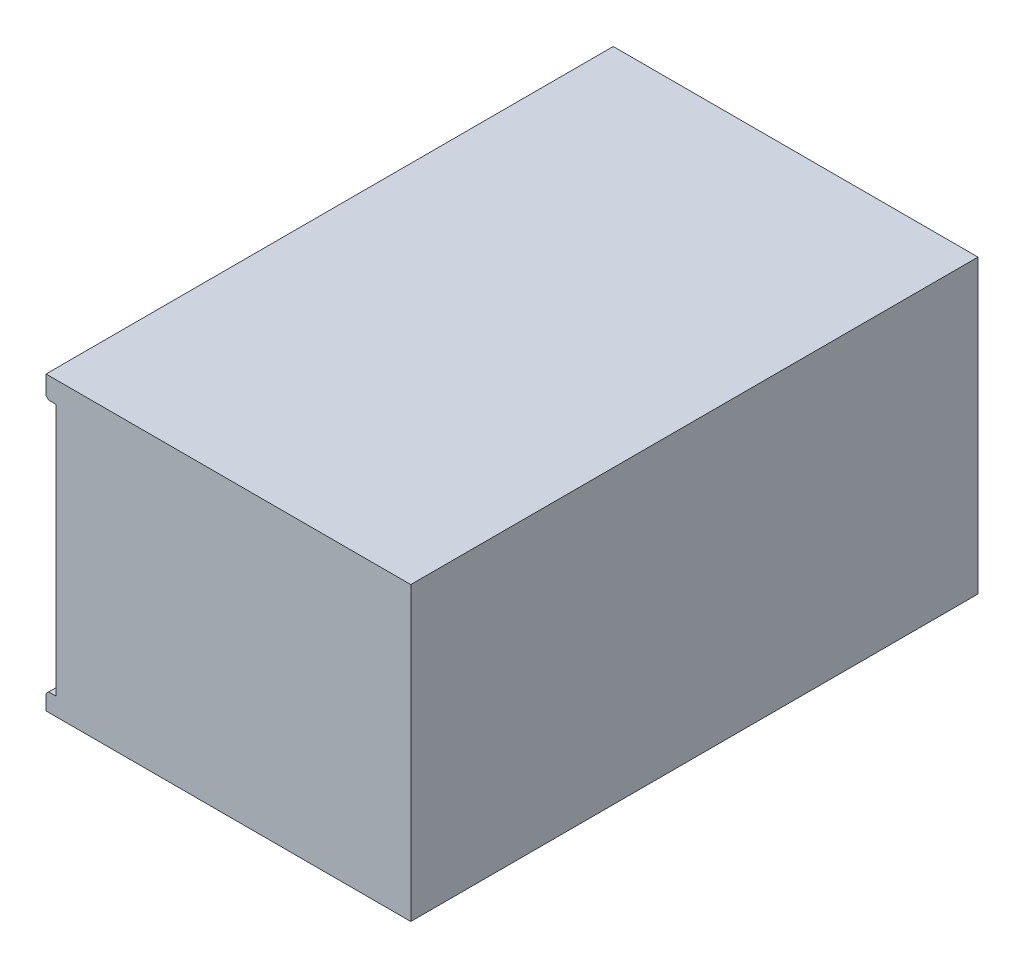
ISO-10303-21;
HEADER;
FILE_DESCRIPTION(('STEP AP214'),'2;1');
FILE_NAME('part.step','',(''),(''),'','','');
FILE_SCHEMA(('AUTOMOTIVE_DESIGN { 1 0 10303 214 1 1 1 1 }'));
ENDSEC;
DATA;
#1=APPLICATION_CONTEXT('core data for automotive mechanical design processes');
#2=APPLICATION_PROTOCOL_DEFINITION('international standard','automotive_design',2000,#1);
#3=PRODUCT_CONTEXT('',#1,'mechanical');
#4=PRODUCT('Part','Part','',(#3));
#5=PRODUCT_RELATED_PRODUCT_CATEGORY('part','',(#4));
#6=PRODUCT_DEFINITION_FORMATION('','',#4);
#7=PRODUCT_DEFINITION_CONTEXT('part definition',#1,'design');
#8=PRODUCT_DEFINITION('design','',#6,#7);
#9=PRODUCT_DEFINITION_SHAPE('','',#8);
#10=(LENGTH_UNIT() NAMED_UNIT(*) SI_UNIT(.MILLI.,.METRE.));
#11=(NAMED_UNIT(*) PLANE_ANGLE_UNIT() SI_UNIT($,.RADIAN.));
#12=(NAMED_UNIT(*) SI_UNIT($,.STERADIAN.) SOLID_ANGLE_UNIT());
#13=UNCERTAINTY_MEASURE_WITH_UNIT(LENGTH_MEASURE(1.E-05),#10,'distance_accuracy_value','');
#14=(GEOMETRIC_REPRESENTATION_CONTEXT(3) GLOBAL_UNCERTAINTY_ASSIGNED_CONTEXT((#13)) GLOBAL_UNIT_ASSIGNED_CONTEXT((#10,
#11,#12)) REPRESENTATION_CONTEXT('',''));
#15=CARTESIAN_POINT('',(0.,0.,0.));
#16=DIRECTION('',(0.,0.,1.));
#17=DIRECTION('',(1.,0.,0.));
#18=AXIS2_PLACEMENT_3D('',#15,#16,#17);
#19=CARTESIAN_POINT('',(-1.397,0.,40.4876));
#20=DIRECTION('',(0.,-1.,0.));
#21=DIRECTION('',(0.,0.,-1.));
#22=AXIS2_PLACEMENT_3D('',#19,#20,#21);
#23=PLANE('',#22);
#24=DIRECTION('',(-1.,0.,0.));
#25=VECTOR('',#24,1.);
#26=CARTESIAN_POINT('',(-1.397,0.,-40.4876));
#27=LINE('',#26,#25);
#28=CARTESIAN_POINT('',(50.673,0.,-40.4876));
#29=VERTEX_POINT('',#28);
#30=CARTESIAN_POINT('',(-1.397,0.,-40.4876));
#31=VERTEX_POINT('',#30);
#32=EDGE_CURVE('E180',#29,#31,#27,.T.);
#33=ORIENTED_EDGE('',*,*,#32,.T.);
#34=DIRECTION('',(0.,0.,-1.));
#35=VECTOR('',#34,1.);
#36=CARTESIAN_POINT('',(-1.397,0.,40.4876));
#37=LINE('',#36,#35);
#38=CARTESIAN_POINT('',(-1.397,0.,40.4876));
#39=VERTEX_POINT('',#38);
#40=EDGE_CURVE('E231',#39,#31,#37,.T.);
#41=ORIENTED_EDGE('',*,*,#40,.F.);
#42=DIRECTION('',(-1.,0.,0.));
#43=VECTOR('',#42,1.);
#44=CARTESIAN_POINT('',(-1.397,0.,40.4876));
#45=LINE('',#44,#43);
#46=CARTESIAN_POINT('',(50.673,0.,40.4876));
#47=VERTEX_POINT('',#46);
#48=EDGE_CURVE('E181',#47,#39,#45,.T.);
#49=ORIENTED_EDGE('',*,*,#48,.F.);
#50=DIRECTION('',(0.,0.,-1.));
#51=VECTOR('',#50,1.);
#52=CARTESIAN_POINT('',(50.673,0.,40.4876));
#53=LINE('',#52,#51);
#54=EDGE_CURVE('E200',#47,#29,#53,.T.);
#55=ORIENTED_EDGE('',*,*,#54,.T.);
#56=EDGE_LOOP('',(#33,#41,#49,#55));
#57=FACE_BOUND('',#56,.T.);
#58=ADVANCED_FACE('F37',(#57),#23,.F.);
#59=CARTESIAN_POINT('',(-1.397,-3.048,40.4876));
#60=DIRECTION('',(1.,0.,0.));
#61=DIRECTION('',(0.,0.,-1.));
#62=AXIS2_PLACEMENT_3D('',#59,#60,#61);
#63=PLANE('',#62);
#64=DIRECTION('',(0.,-1.,0.));
#65=VECTOR('',#64,1.);
#66=CARTESIAN_POINT('',(-1.397,-3.048,-40.4876));
#67=LINE('',#66,#65);
#68=CARTESIAN_POINT('',(-1.397,-2.66699999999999,-40.4876));
#69=VERTEX_POINT('',#68);
#70=EDGE_CURVE('E203',#31,#69,#67,.T.);
#71=ORIENTED_EDGE('',*,*,#70,.T.);
#72=DIRECTION('',(0.,0.,1.));
#73=VECTOR('',#72,1.);
#74=CARTESIAN_POINT('',(-1.397,-2.66699999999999,40.4876));
#75=LINE('',#74,#73);
#76=CARTESIAN_POINT('',(-1.397,-2.66699999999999,40.4876));
#77=VERTEX_POINT('',#76);
#78=EDGE_CURVE('E11',#69,#77,#75,.T.);
#79=ORIENTED_EDGE('',*,*,#78,.T.);
#80=DIRECTION('',(0.,-1.,0.));
#81=VECTOR('',#80,1.);
#82=CARTESIAN_POINT('',(-1.397,-3.048,40.4876));
#83=LINE('',#82,#81);
#84=EDGE_CURVE('E184',#39,#77,#83,.T.);
#85=ORIENTED_EDGE('',*,*,#84,.F.);
#86=ORIENTED_EDGE('',*,*,#40,.T.);
#87=EDGE_LOOP('',(#71,#79,#85,#86));
#88=FACE_BOUND('',#87,.T.);
#89=ADVANCED_FACE('F287',(#88),#63,.F.);
#90=CARTESIAN_POINT('',(0.,-3.048,40.4876));
#91=DIRECTION('',(0.,1.,0.));
#92=DIRECTION('',(0.,0.,1.));
#93=AXIS2_PLACEMENT_3D('',#90,#91,#92);
#94=PLANE('',#93);
#95=DIRECTION('',(1.,0.,0.));
#96=VECTOR('',#95,1.);
#97=CARTESIAN_POINT('',(0.,-3.048,40.4876));
#98=LINE('',#97,#96);
#99=CARTESIAN_POINT('',(-1.016,-3.048,40.4876));
#100=VERTEX_POINT('',#99);
#101=CARTESIAN_POINT('',(0.,-3.048,40.4876));
#102=VERTEX_POINT('',#101);
#103=EDGE_CURVE('E187',#100,#102,#98,.T.);
#104=ORIENTED_EDGE('',*,*,#103,.F.);
#105=DIRECTION('',(0.,0.,-1.));
#106=VECTOR('',#105,1.);
#107=CARTESIAN_POINT('',(-1.016,-3.048,40.4876));
#108=LINE('',#107,#106);
#109=CARTESIAN_POINT('',(-1.016,-3.048,-40.4876));
#110=VERTEX_POINT('',#109);
#111=EDGE_CURVE('E45',#100,#110,#108,.T.);
#112=ORIENTED_EDGE('',*,*,#111,.T.);
#113=DIRECTION('',(1.,0.,0.));
#114=VECTOR('',#113,1.);
#115=CARTESIAN_POINT('',(0.,-3.048,-40.4876));
#116=LINE('',#115,#114);
#117=CARTESIAN_POINT('',(0.,-3.048,-40.4876));
#118=VERTEX_POINT('',#117);
#119=EDGE_CURVE('E205',#110,#118,#116,.T.);
#120=ORIENTED_EDGE('',*,*,#119,.T.);
#121=DIRECTION('',(0.,0.,-1.));
#122=VECTOR('',#121,1.);
#123=CARTESIAN_POINT('',(0.,-3.048,40.4876));
#124=LINE('',#123,#122);
#125=EDGE_CURVE('E228',#102,#118,#124,.T.);
#126=ORIENTED_EDGE('',*,*,#125,.F.);
#127=EDGE_LOOP('',(#104,#112,#120,#126));
#128=FACE_BOUND('',#127,.T.);
#129=ADVANCED_FACE('F249',(#128),#94,.F.);
#130=CARTESIAN_POINT('',(0.,-39.116,40.4876));
#131=DIRECTION('',(1.,0.,0.));
#132=DIRECTION('',(0.,0.,-1.));
#133=AXIS2_PLACEMENT_3D('',#130,#131,#132);
#134=PLANE('',#133);
#135=CARTESIAN_POINT('',(0.,-6.35,-35.179));
#136=DIRECTION('',(-1.,0.,0.));
#137=DIRECTION('',(0.,0.,1.));
#138=AXIS2_PLACEMENT_3D('',#135,#136,#137);
#139=CIRCLE('',#138,2.413);
#140=CARTESIAN_POINT('',(0.,-6.35,-32.766));
#141=VERTEX_POINT('',#140);
#142=EDGE_CURVE('E141',#141,#141,#139,.T.);
#143=ORIENTED_EDGE('',*,*,#142,.F.);
#144=EDGE_LOOP('',(#143));
#145=FACE_BOUND('',#144,.T.);
#146=CARTESIAN_POINT('',(0.,-6.35,35.179));
#147=DIRECTION('',(-1.,0.,0.));
#148=DIRECTION('',(0.,0.,1.));
#149=AXIS2_PLACEMENT_3D('',#146,#147,#148);
#150=CIRCLE('',#149,2.413);
#151=CARTESIAN_POINT('',(0.,-6.35,37.592));
#152=VERTEX_POINT('',#151);
#153=EDGE_CURVE('E153',#152,#152,#150,.T.);
#154=ORIENTED_EDGE('',*,*,#153,.F.);
#155=EDGE_LOOP('',(#154));
#156=FACE_BOUND('',#155,.T.);
#157=CARTESIAN_POINT('',(0.,-35.814,-35.179));
#158=DIRECTION('',(-1.,0.,0.));
#159=DIRECTION('',(0.,0.,1.));
#160=AXIS2_PLACEMENT_3D('',#157,#158,#159);
#161=CIRCLE('',#160,2.413);
#162=CARTESIAN_POINT('',(0.,-35.814,-32.766));
#163=VERTEX_POINT('',#162);
#164=EDGE_CURVE('E165',#163,#163,#161,.T.);
#165=ORIENTED_EDGE('',*,*,#164,.F.);
#166=EDGE_LOOP('',(#165));
#167=FACE_BOUND('',#166,.T.);
#168=CARTESIAN_POINT('',(0.,-35.814,35.179));
#169=DIRECTION('',(-1.,0.,0.));
#170=DIRECTION('',(0.,0.,1.));
#171=AXIS2_PLACEMENT_3D('',#168,#169,#170);
#172=CIRCLE('',#171,2.413);
#173=CARTESIAN_POINT('',(0.,-35.814,37.592));
#174=VERTEX_POINT('',#173);
#175=EDGE_CURVE('E177',#174,#174,#172,.T.);
#176=ORIENTED_EDGE('',*,*,#175,.F.);
#177=EDGE_LOOP('',(#176));
#178=FACE_BOUND('',#177,.T.);
#179=DIRECTION('',(0.,-1.,0.));
#180=VECTOR('',#179,1.);
#181=CARTESIAN_POINT('',(0.,-39.116,-40.4876));
#182=LINE('',#181,#180);
#183=CARTESIAN_POINT('',(0.,-39.116,-40.4876));
#184=VERTEX_POINT('',#183);
#185=EDGE_CURVE('E207',#118,#184,#182,.T.);
#186=ORIENTED_EDGE('',*,*,#185,.T.);
#187=DIRECTION('',(0.,0.,-1.));
#188=VECTOR('',#187,1.);
#189=CARTESIAN_POINT('',(0.,-39.116,40.4876));
#190=LINE('',#189,#188);
#191=CARTESIAN_POINT('',(0.,-39.116,40.4876));
#192=VERTEX_POINT('',#191);
#193=EDGE_CURVE('E225',#192,#184,#190,.T.);
#194=ORIENTED_EDGE('',*,*,#193,.F.);
#195=DIRECTION('',(0.,-1.,0.));
#196=VECTOR('',#195,1.);
#197=CARTESIAN_POINT('',(0.,-39.116,40.4876));
#198=LINE('',#197,#196);
#199=EDGE_CURVE('E189',#102,#192,#198,.T.);
#200=ORIENTED_EDGE('',*,*,#199,.F.);
#201=ORIENTED_EDGE('',*,*,#125,.T.);
#202=EDGE_LOOP('',(#186,#194,#200,#201));
#203=FACE_BOUND('',#202,.T.);
#204=ADVANCED_FACE('F259',(#145,#156,#167,#178,#203),#134,.F.);
#205=CARTESIAN_POINT('',(-1.397,-39.116,40.4876));
#206=DIRECTION('',(0.,-1.,0.));
#207=DIRECTION('',(0.,0.,-1.));
#208=AXIS2_PLACEMENT_3D('',#205,#206,#207);
#209=PLANE('',#208);
#210=DIRECTION('',(-1.,0.,0.));
#211=VECTOR('',#210,1.);
#212=CARTESIAN_POINT('',(-1.397,-39.116,-40.4876));
#213=LINE('',#212,#211);
#214=CARTESIAN_POINT('',(-1.01599999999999,-39.116,-40.4876));
#215=VERTEX_POINT('',#214);
#216=EDGE_CURVE('E209',#184,#215,#213,.T.);
#217=ORIENTED_EDGE('',*,*,#216,.T.);
#218=DIRECTION('',(0.,0.,1.));
#219=VECTOR('',#218,1.);
#220=CARTESIAN_POINT('',(-1.01599999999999,-39.116,40.4876));
#221=LINE('',#220,#219);
#222=CARTESIAN_POINT('',(-1.01599999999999,-39.116,40.4876));
#223=VERTEX_POINT('',#222);
#224=EDGE_CURVE('E241',#215,#223,#221,.T.);
#225=ORIENTED_EDGE('',*,*,#224,.T.);
#226=DIRECTION('',(-1.,0.,0.));
#227=VECTOR('',#226,1.);
#228=CARTESIAN_POINT('',(-1.397,-39.116,40.4876));
#229=LINE('',#228,#227);
#230=EDGE_CURVE('E191',#192,#223,#229,.T.);
#231=ORIENTED_EDGE('',*,*,#230,.F.);
#232=ORIENTED_EDGE('',*,*,#193,.T.);
#233=EDGE_LOOP('',(#217,#225,#231,#232));
#234=FACE_BOUND('',#233,.T.);
#235=ADVANCED_FACE('F263',(#234),#209,.F.);
#236=CARTESIAN_POINT('',(-1.397,-41.656,40.4876));
#237=DIRECTION('',(1.,0.,0.));
#238=DIRECTION('',(0.,0.,-1.));
#239=AXIS2_PLACEMENT_3D('',#236,#237,#238);
#240=PLANE('',#239);
#241=DIRECTION('',(0.,-1.,0.));
#242=VECTOR('',#241,1.);
#243=CARTESIAN_POINT('',(-1.397,-41.656,40.4876));
#244=LINE('',#243,#242);
#245=CARTESIAN_POINT('',(-1.397,-39.497,40.4876));
#246=VERTEX_POINT('',#245);
#247=CARTESIAN_POINT('',(-1.397,-41.656,40.4876));
#248=VERTEX_POINT('',#247);
#249=EDGE_CURVE('E194',#246,#248,#244,.T.);
#250=ORIENTED_EDGE('',*,*,#249,.F.);
#251=DIRECTION('',(0.,0.,-1.));
#252=VECTOR('',#251,1.);
#253=CARTESIAN_POINT('',(-1.397,-39.497,40.4876));
#254=LINE('',#253,#252);
#255=CARTESIAN_POINT('',(-1.397,-39.497,-40.4876));
#256=VERTEX_POINT('',#255);
#257=EDGE_CURVE('E234',#246,#256,#254,.T.);
#258=ORIENTED_EDGE('',*,*,#257,.T.);
#259=DIRECTION('',(0.,-1.,0.));
#260=VECTOR('',#259,1.);
#261=CARTESIAN_POINT('',(-1.397,-41.656,-40.4876));
#262=LINE('',#261,#260);
#263=CARTESIAN_POINT('',(-1.397,-41.656,-40.4876));
#264=VERTEX_POINT('',#263);
#265=EDGE_CURVE('E212',#256,#264,#262,.T.);
#266=ORIENTED_EDGE('',*,*,#265,.T.);
#267=DIRECTION('',(0.,0.,-1.));
#268=VECTOR('',#267,1.);
#269=CARTESIAN_POINT('',(-1.397,-41.656,40.4876));
#270=LINE('',#269,#268);
#271=EDGE_CURVE('E222',#248,#264,#270,.T.);
#272=ORIENTED_EDGE('',*,*,#271,.F.);
#273=EDGE_LOOP('',(#250,#258,#266,#272));
#274=FACE_BOUND('',#273,.T.);
#275=ADVANCED_FACE('F271',(#274),#240,.F.);
#276=CARTESIAN_POINT('',(50.673,-41.656,40.4876));
#277=DIRECTION('',(0.,1.,0.));
#278=DIRECTION('',(-1.,0.,0.));
#279=AXIS2_PLACEMENT_3D('',#276,#277,#278);
#280=PLANE('',#279);
#281=DIRECTION('',(1.,0.,0.));
#282=VECTOR('',#281,1.);
#283=CARTESIAN_POINT('',(50.673,-41.656,-40.4876));
#284=LINE('',#283,#282);
#285=CARTESIAN_POINT('',(50.673,-41.656,-40.4876));
#286=VERTEX_POINT('',#285);
#287=EDGE_CURVE('E214',#264,#286,#284,.T.);
#288=ORIENTED_EDGE('',*,*,#287,.T.);
#289=DIRECTION('',(0.,0.,-1.));
#290=VECTOR('',#289,1.);
#291=CARTESIAN_POINT('',(50.673,-41.656,40.4876));
#292=LINE('',#291,#290);
#293=CARTESIAN_POINT('',(50.673,-41.656,40.4876));
#294=VERTEX_POINT('',#293);
#295=EDGE_CURVE('E219',#294,#286,#292,.T.);
#296=ORIENTED_EDGE('',*,*,#295,.F.);
#297=DIRECTION('',(1.,0.,0.));
#298=VECTOR('',#297,1.);
#299=CARTESIAN_POINT('',(50.673,-41.656,40.4876));
#300=LINE('',#299,#298);
#301=EDGE_CURVE('E196',#248,#294,#300,.T.);
#302=ORIENTED_EDGE('',*,*,#301,.F.);
#303=ORIENTED_EDGE('',*,*,#271,.T.);
#304=EDGE_LOOP('',(#288,#296,#302,#303));
#305=FACE_BOUND('',#304,.T.);
#306=ADVANCED_FACE('F278',(#305),#280,.F.);
#307=CARTESIAN_POINT('',(50.673,0.,40.4876));
#308=DIRECTION('',(-1.,0.,0.));
#309=DIRECTION('',(0.,0.,1.));
#310=AXIS2_PLACEMENT_3D('',#307,#308,#309);
#311=PLANE('',#310);
#312=DIRECTION('',(0.,1.,0.));
#313=VECTOR('',#312,1.);
#314=CARTESIAN_POINT('',(50.673,0.,-40.4876));
#315=LINE('',#314,#313);
#316=EDGE_CURVE('E185',#286,#29,#315,.T.);
#317=ORIENTED_EDGE('',*,*,#316,.T.);
#318=ORIENTED_EDGE('',*,*,#54,.F.);
#319=DIRECTION('',(0.,1.,0.));
#320=VECTOR('',#319,1.);
#321=CARTESIAN_POINT('',(50.673,0.,40.4876));
#322=LINE('',#321,#320);
#323=EDGE_CURVE('E198',#294,#47,#322,.T.);
#324=ORIENTED_EDGE('',*,*,#323,.F.);
#325=ORIENTED_EDGE('',*,*,#295,.T.);
#326=EDGE_LOOP('',(#317,#318,#324,#325));
#327=FACE_BOUND('',#326,.T.);
#328=ADVANCED_FACE('F282',(#327),#311,.F.);
#329=CARTESIAN_POINT('',(50.673,0.,40.4876));
#330=DIRECTION('',(0.,0.,-1.));
#331=DIRECTION('',(-1.,0.,0.));
#332=AXIS2_PLACEMENT_3D('',#329,#330,#331);
#333=PLANE('',#332);
#334=ORIENTED_EDGE('',*,*,#230,.T.);
#335=DIRECTION('',(0.70710678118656,0.707106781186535,0.));
#336=VECTOR('',#335,1.);
#337=CARTESIAN_POINT('',(-1.397,-39.497,40.4876));
#338=LINE('',#337,#336);
#339=EDGE_CURVE('E244',#223,#246,#338,.F.);
#340=ORIENTED_EDGE('',*,*,#339,.T.);
#341=ORIENTED_EDGE('',*,*,#249,.T.);
#342=ORIENTED_EDGE('',*,*,#301,.T.);
#343=ORIENTED_EDGE('',*,*,#323,.T.);
#344=ORIENTED_EDGE('',*,*,#48,.T.);
#345=ORIENTED_EDGE('',*,*,#84,.T.);
#346=DIRECTION('',(-0.707106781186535,0.70710678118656,0.));
#347=VECTOR('',#346,1.);
#348=CARTESIAN_POINT('',(-1.016,-3.048,40.4876));
#349=LINE('',#348,#347);
#350=EDGE_CURVE('E52',#77,#100,#349,.F.);
#351=ORIENTED_EDGE('',*,*,#350,.T.);
#352=ORIENTED_EDGE('',*,*,#103,.T.);
#353=ORIENTED_EDGE('',*,*,#199,.T.);
#354=EDGE_LOOP('',(#334,#340,#341,#342,#343,#344,#345,#351,#352,#353));
#355=FACE_BOUND('',#354,.T.);
#356=ADVANCED_FACE('F266',(#355),#333,.F.);
#357=CARTESIAN_POINT('',(50.673,0.,-40.4876));
#358=DIRECTION('',(0.,0.,-1.));
#359=DIRECTION('',(-1.,0.,0.));
#360=AXIS2_PLACEMENT_3D('',#357,#358,#359);
#361=PLANE('',#360);
#362=ORIENTED_EDGE('',*,*,#265,.F.);
#363=DIRECTION('',(-0.70710678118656,-0.707106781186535,0.));
#364=VECTOR('',#363,1.);
#365=CARTESIAN_POINT('',(44.386500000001,6.28649999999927,-40.4876));
#366=LINE('',#365,#364);
#367=EDGE_CURVE('E239',#256,#215,#366,.F.);
#368=ORIENTED_EDGE('',*,*,#367,.T.);
#369=ORIENTED_EDGE('',*,*,#216,.F.);
#370=ORIENTED_EDGE('',*,*,#185,.F.);
#371=ORIENTED_EDGE('',*,*,#119,.F.);
#372=DIRECTION('',(0.707106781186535,-0.70710678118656,0.));
#373=VECTOR('',#372,1.);
#374=CARTESIAN_POINT('',(23.3044999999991,-27.3684999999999,-40.4876));
#375=LINE('',#374,#373);
#376=EDGE_CURVE('E237',#110,#69,#375,.F.);
#377=ORIENTED_EDGE('',*,*,#376,.T.);
#378=ORIENTED_EDGE('',*,*,#70,.F.);
#379=ORIENTED_EDGE('',*,*,#32,.F.);
#380=ORIENTED_EDGE('',*,*,#316,.F.);
#381=ORIENTED_EDGE('',*,*,#287,.F.);
#382=EDGE_LOOP('',(#362,#368,#369,#370,#371,#377,#378,#379,#380,#381));
#383=FACE_BOUND('',#382,.T.);
#384=ADVANCED_FACE('F255',(#383),#361,.T.);
#385=CARTESIAN_POINT('',(0.,-35.814,35.179));
#386=DIRECTION('',(-1.,0.,0.));
#387=DIRECTION('',(0.,0.,1.));
#388=AXIS2_PLACEMENT_3D('',#385,#386,#387);
#389=CYLINDRICAL_SURFACE('',#388,2.413);
#390=CARTESIAN_POINT('',(7.62,-35.814,35.179));
#391=DIRECTION('',(-1.,0.,0.));
#392=DIRECTION('',(0.,0.,1.));
#393=AXIS2_PLACEMENT_3D('',#390,#391,#392);
#394=CIRCLE('',#393,2.413);
#395=CARTESIAN_POINT('',(7.62,-35.814,37.592));
#396=VERTEX_POINT('',#395);
#397=EDGE_CURVE('E174',#396,#396,#394,.T.);
#398=ORIENTED_EDGE('',*,*,#397,.F.);
#399=EDGE_LOOP('',(#398));
#400=FACE_BOUND('',#399,.T.);
#401=ORIENTED_EDGE('',*,*,#175,.T.);
#402=EDGE_LOOP('',(#401));
#403=FACE_BOUND('',#402,.T.);
#404=ADVANCED_FACE('F314',(#400,#403),#389,.F.);
#405=CARTESIAN_POINT('',(7.62,-33.7947,35.179));
#406=DIRECTION('',(1.,0.,0.));
#407=DIRECTION('',(0.,0.,-1.));
#408=AXIS2_PLACEMENT_3D('',#405,#406,#407);
#409=PLANE('',#408);
#410=CARTESIAN_POINT('',(7.62,-35.814,35.179));
#411=DIRECTION('',(-1.,0.,0.));
#412=DIRECTION('',(0.,0.,1.));
#413=AXIS2_PLACEMENT_3D('',#410,#411,#412);
#414=CIRCLE('',#413,2.0193);
#415=CARTESIAN_POINT('',(7.62,-35.814,37.1983));
#416=VERTEX_POINT('',#415);
#417=EDGE_CURVE('E171',#416,#416,#414,.T.);
#418=ORIENTED_EDGE('',*,*,#417,.F.);
#419=EDGE_LOOP('',(#418));
#420=FACE_BOUND('',#419,.T.);
#421=ORIENTED_EDGE('',*,*,#397,.T.);
#422=EDGE_LOOP('',(#421));
#423=FACE_BOUND('',#422,.T.);
#424=ADVANCED_FACE('F319',(#420,#423),#409,.F.);
#425=CARTESIAN_POINT('',(0.,-35.814,35.179));
#426=DIRECTION('',(-1.,0.,0.));
#427=DIRECTION('',(0.,0.,1.));
#428=AXIS2_PLACEMENT_3D('',#425,#426,#427);
#429=CYLINDRICAL_SURFACE('',#428,2.0193);
#430=CARTESIAN_POINT('',(9.99744,-35.814,35.179));
#431=DIRECTION('',(-1.,0.,0.));
#432=DIRECTION('',(0.,0.,1.));
#433=AXIS2_PLACEMENT_3D('',#430,#431,#432);
#434=CIRCLE('',#433,2.01929999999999);
#435=CARTESIAN_POINT('',(9.99744,-35.814,37.1983));
#436=VERTEX_POINT('',#435);
#437=EDGE_CURVE('E168',#436,#436,#434,.T.);
#438=ORIENTED_EDGE('',*,*,#437,.F.);
#439=EDGE_LOOP('',(#438));
#440=FACE_BOUND('',#439,.T.);
#441=ORIENTED_EDGE('',*,*,#417,.T.);
#442=EDGE_LOOP('',(#441));
#443=FACE_BOUND('',#442,.T.);
#444=ADVANCED_FACE('F323',(#440,#443),#429,.F.);
#445=CARTESIAN_POINT('',(9.99744,-35.814,35.179));
#446=DIRECTION('',(-1.,0.,0.));
#447=DIRECTION('',(0.,0.,1.));
#448=AXIS2_PLACEMENT_3D('',#445,#446,#447);
#449=CONICAL_SURFACE('',#448,2.01929999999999,1.02974425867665);
#450=CARTESIAN_POINT('',(11.2107578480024,-35.814,35.179));
#451=VERTEX_POINT('',#450);
#452=VERTEX_LOOP('',#451);
#453=FACE_BOUND('',#452,.T.);
#454=ORIENTED_EDGE('',*,*,#437,.T.);
#455=EDGE_LOOP('',(#454));
#456=FACE_BOUND('',#455,.T.);
#457=ADVANCED_FACE('F327',(#453,#456),#449,.F.);
#458=CARTESIAN_POINT('',(0.,-35.814,-35.179));
#459=DIRECTION('',(-1.,0.,0.));
#460=DIRECTION('',(0.,0.,1.));
#461=AXIS2_PLACEMENT_3D('',#458,#459,#460);
#462=CYLINDRICAL_SURFACE('',#461,2.413);
#463=CARTESIAN_POINT('',(7.62,-35.814,-35.179));
#464=DIRECTION('',(-1.,0.,0.));
#465=DIRECTION('',(0.,0.,1.));
#466=AXIS2_PLACEMENT_3D('',#463,#464,#465);
#467=CIRCLE('',#466,2.413);
#468=CARTESIAN_POINT('',(7.62,-35.814,-32.766));
#469=VERTEX_POINT('',#468);
#470=EDGE_CURVE('E162',#469,#469,#467,.T.);
#471=ORIENTED_EDGE('',*,*,#470,.F.);
#472=EDGE_LOOP('',(#471));
#473=FACE_BOUND('',#472,.T.);
#474=ORIENTED_EDGE('',*,*,#164,.T.);
#475=EDGE_LOOP('',(#474));
#476=FACE_BOUND('',#475,.T.);
#477=ADVANCED_FACE('F331',(#473,#476),#462,.F.);
#478=CARTESIAN_POINT('',(7.62,-33.7947,-35.179));
#479=DIRECTION('',(1.,0.,0.));
#480=DIRECTION('',(0.,0.,-1.));
#481=AXIS2_PLACEMENT_3D('',#478,#479,#480);
#482=PLANE('',#481);
#483=CARTESIAN_POINT('',(7.62,-35.814,-35.179));
#484=DIRECTION('',(-1.,0.,0.));
#485=DIRECTION('',(0.,0.,1.));
#486=AXIS2_PLACEMENT_3D('',#483,#484,#485);
#487=CIRCLE('',#486,2.0193);
#488=CARTESIAN_POINT('',(7.62,-35.814,-33.1597));
#489=VERTEX_POINT('',#488);
#490=EDGE_CURVE('E159',#489,#489,#487,.T.);
#491=ORIENTED_EDGE('',*,*,#490,.F.);
#492=EDGE_LOOP('',(#491));
#493=FACE_BOUND('',#492,.T.);
#494=ORIENTED_EDGE('',*,*,#470,.T.);
#495=EDGE_LOOP('',(#494));
#496=FACE_BOUND('',#495,.T.);
#497=ADVANCED_FACE('F335',(#493,#496),#482,.F.);
#498=CARTESIAN_POINT('',(0.,-35.814,-35.179));
#499=DIRECTION('',(-1.,0.,0.));
#500=DIRECTION('',(0.,0.,1.));
#501=AXIS2_PLACEMENT_3D('',#498,#499,#500);
#502=CYLINDRICAL_SURFACE('',#501,2.0193);
#503=CARTESIAN_POINT('',(9.99744,-35.814,-35.179));
#504=DIRECTION('',(-1.,0.,0.));
#505=DIRECTION('',(0.,0.,1.));
#506=AXIS2_PLACEMENT_3D('',#503,#504,#505);
#507=CIRCLE('',#506,2.01929999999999);
#508=CARTESIAN_POINT('',(9.99744,-35.814,-33.1597));
#509=VERTEX_POINT('',#508);
#510=EDGE_CURVE('E156',#509,#509,#507,.T.);
#511=ORIENTED_EDGE('',*,*,#510,.F.);
#512=EDGE_LOOP('',(#511));
#513=FACE_BOUND('',#512,.T.);
#514=ORIENTED_EDGE('',*,*,#490,.T.);
#515=EDGE_LOOP('',(#514));
#516=FACE_BOUND('',#515,.T.);
#517=ADVANCED_FACE('F339',(#513,#516),#502,.F.);
#518=CARTESIAN_POINT('',(9.99744,-35.814,-35.179));
#519=DIRECTION('',(-1.,0.,0.));
#520=DIRECTION('',(0.,0.,1.));
#521=AXIS2_PLACEMENT_3D('',#518,#519,#520);
#522=CONICAL_SURFACE('',#521,2.01929999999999,1.02974425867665);
#523=CARTESIAN_POINT('',(11.2107578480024,-35.814,-35.179));
#524=VERTEX_POINT('',#523);
#525=VERTEX_LOOP('',#524);
#526=FACE_BOUND('',#525,.T.);
#527=ORIENTED_EDGE('',*,*,#510,.T.);
#528=EDGE_LOOP('',(#527));
#529=FACE_BOUND('',#528,.T.);
#530=ADVANCED_FACE('F343',(#526,#529),#522,.F.);
#531=CARTESIAN_POINT('',(0.,-6.35,35.179));
#532=DIRECTION('',(-1.,0.,0.));
#533=DIRECTION('',(0.,0.,1.));
#534=AXIS2_PLACEMENT_3D('',#531,#532,#533);
#535=CYLINDRICAL_SURFACE('',#534,2.413);
#536=CARTESIAN_POINT('',(7.62,-6.35,35.179));
#537=DIRECTION('',(-1.,0.,0.));
#538=DIRECTION('',(0.,0.,1.));
#539=AXIS2_PLACEMENT_3D('',#536,#537,#538);
#540=CIRCLE('',#539,2.413);
#541=CARTESIAN_POINT('',(7.62,-6.35,37.592));
#542=VERTEX_POINT('',#541);
#543=EDGE_CURVE('E150',#542,#542,#540,.T.);
#544=ORIENTED_EDGE('',*,*,#543,.F.);
#545=EDGE_LOOP('',(#544));
#546=FACE_BOUND('',#545,.T.);
#547=ORIENTED_EDGE('',*,*,#153,.T.);
#548=EDGE_LOOP('',(#547));
#549=FACE_BOUND('',#548,.T.);
#550=ADVANCED_FACE('F347',(#546,#549),#535,.F.);
#551=CARTESIAN_POINT('',(7.62,-4.3307,35.179));
#552=DIRECTION('',(1.,0.,0.));
#553=DIRECTION('',(0.,0.,-1.));
#554=AXIS2_PLACEMENT_3D('',#551,#552,#553);
#555=PLANE('',#554);
#556=CARTESIAN_POINT('',(7.62,-6.35,35.179));
#557=DIRECTION('',(-1.,0.,0.));
#558=DIRECTION('',(0.,0.,1.));
#559=AXIS2_PLACEMENT_3D('',#556,#557,#558);
#560=CIRCLE('',#559,2.0193);
#561=CARTESIAN_POINT('',(7.62,-6.35,37.1983));
#562=VERTEX_POINT('',#561);
#563=EDGE_CURVE('E147',#562,#562,#560,.T.);
#564=ORIENTED_EDGE('',*,*,#563,.F.);
#565=EDGE_LOOP('',(#564));
#566=FACE_BOUND('',#565,.T.);
#567=ORIENTED_EDGE('',*,*,#543,.T.);
#568=EDGE_LOOP('',(#567));
#569=FACE_BOUND('',#568,.T.);
#570=ADVANCED_FACE('F351',(#566,#569),#555,.F.);
#571=CARTESIAN_POINT('',(0.,-6.35,35.179));
#572=DIRECTION('',(-1.,0.,0.));
#573=DIRECTION('',(0.,0.,1.));
#574=AXIS2_PLACEMENT_3D('',#571,#572,#573);
#575=CYLINDRICAL_SURFACE('',#574,2.0193);
#576=CARTESIAN_POINT('',(9.99744,-6.35,35.179));
#577=DIRECTION('',(-1.,0.,0.));
#578=DIRECTION('',(0.,0.,1.));
#579=AXIS2_PLACEMENT_3D('',#576,#577,#578);
#580=CIRCLE('',#579,2.0193);
#581=CARTESIAN_POINT('',(9.99744,-6.35,37.1983));
#582=VERTEX_POINT('',#581);
#583=EDGE_CURVE('E144',#582,#582,#580,.T.);
#584=ORIENTED_EDGE('',*,*,#583,.F.);
#585=EDGE_LOOP('',(#584));
#586=FACE_BOUND('',#585,.T.);
#587=ORIENTED_EDGE('',*,*,#563,.T.);
#588=EDGE_LOOP('',(#587));
#589=FACE_BOUND('',#588,.T.);
#590=ADVANCED_FACE('F355',(#586,#589),#575,.F.);
#591=CARTESIAN_POINT('',(9.99744,-6.35,35.179));
#592=DIRECTION('',(-1.,0.,0.));
#593=DIRECTION('',(0.,0.,1.));
#594=AXIS2_PLACEMENT_3D('',#591,#592,#593);
#595=CONICAL_SURFACE('',#594,2.0193,1.02974425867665);
#596=CARTESIAN_POINT('',(11.2107578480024,-6.35,35.179));
#597=VERTEX_POINT('',#596);
#598=VERTEX_LOOP('',#597);
#599=FACE_BOUND('',#598,.T.);
#600=ORIENTED_EDGE('',*,*,#583,.T.);
#601=EDGE_LOOP('',(#600));
#602=FACE_BOUND('',#601,.T.);
#603=ADVANCED_FACE('F359',(#599,#602),#595,.F.);
#604=CARTESIAN_POINT('',(0.,-6.35,-35.179));
#605=DIRECTION('',(-1.,0.,0.));
#606=DIRECTION('',(0.,0.,1.));
#607=AXIS2_PLACEMENT_3D('',#604,#605,#606);
#608=CYLINDRICAL_SURFACE('',#607,2.413);
#609=CARTESIAN_POINT('',(7.62,-6.35,-35.179));
#610=DIRECTION('',(-1.,0.,0.));
#611=DIRECTION('',(0.,0.,1.));
#612=AXIS2_PLACEMENT_3D('',#609,#610,#611);
#613=CIRCLE('',#612,2.413);
#614=CARTESIAN_POINT('',(7.62,-6.35,-32.766));
#615=VERTEX_POINT('',#614);
#616=EDGE_CURVE('E136',#615,#615,#613,.T.);
#617=ORIENTED_EDGE('',*,*,#616,.F.);
#618=EDGE_LOOP('',(#617));
#619=FACE_BOUND('',#618,.T.);
#620=ORIENTED_EDGE('',*,*,#142,.T.);
#621=EDGE_LOOP('',(#620));
#622=FACE_BOUND('',#621,.T.);
#623=ADVANCED_FACE('F363',(#619,#622),#608,.F.);
#624=CARTESIAN_POINT('',(7.62,-4.3307,-35.179));
#625=DIRECTION('',(1.,0.,0.));
#626=DIRECTION('',(0.,0.,-1.));
#627=AXIS2_PLACEMENT_3D('',#624,#625,#626);
#628=PLANE('',#627);
#629=CARTESIAN_POINT('',(7.62,-6.35,-35.179));
#630=DIRECTION('',(-1.,0.,0.));
#631=DIRECTION('',(0.,0.,1.));
#632=AXIS2_PLACEMENT_3D('',#629,#630,#631);
#633=CIRCLE('',#632,2.0193);
#634=CARTESIAN_POINT('',(7.62,-6.35,-33.1597));
#635=VERTEX_POINT('',#634);
#636=EDGE_CURVE('E133',#635,#635,#633,.T.);
#637=ORIENTED_EDGE('',*,*,#636,.F.);
#638=EDGE_LOOP('',(#637));
#639=FACE_BOUND('',#638,.T.);
#640=ORIENTED_EDGE('',*,*,#616,.T.);
#641=EDGE_LOOP('',(#640));
#642=FACE_BOUND('',#641,.T.);
#643=ADVANCED_FACE('F367',(#639,#642),#628,.F.);
#644=CARTESIAN_POINT('',(0.,-6.35,-35.179));
#645=DIRECTION('',(-1.,0.,0.));
#646=DIRECTION('',(0.,0.,1.));
#647=AXIS2_PLACEMENT_3D('',#644,#645,#646);
#648=CYLINDRICAL_SURFACE('',#647,2.0193);
#649=CARTESIAN_POINT('',(9.99744,-6.35,-35.179));
#650=DIRECTION('',(-1.,0.,0.));
#651=DIRECTION('',(0.,0.,1.));
#652=AXIS2_PLACEMENT_3D('',#649,#650,#651);
#653=CIRCLE('',#652,2.0193);
#654=CARTESIAN_POINT('',(9.99744,-6.35,-33.1597));
#655=VERTEX_POINT('',#654);
#656=EDGE_CURVE('E131',#655,#655,#653,.T.);
#657=ORIENTED_EDGE('',*,*,#656,.F.);
#658=EDGE_LOOP('',(#657));
#659=FACE_BOUND('',#658,.T.);
#660=ORIENTED_EDGE('',*,*,#636,.T.);
#661=EDGE_LOOP('',(#660));
#662=FACE_BOUND('',#661,.T.);
#663=ADVANCED_FACE('F127',(#659,#662),#648,.F.);
#664=CARTESIAN_POINT('',(9.99744,-6.35,-35.179));
#665=DIRECTION('',(-1.,0.,0.));
#666=DIRECTION('',(0.,0.,1.));
#667=AXIS2_PLACEMENT_3D('',#664,#665,#666);
#668=CONICAL_SURFACE('',#667,2.0193,1.02974425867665);
#669=CARTESIAN_POINT('',(11.2107578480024,-6.35,-35.179));
#670=VERTEX_POINT('',#669);
#671=VERTEX_LOOP('',#670);
#672=FACE_BOUND('',#671,.T.);
#673=ORIENTED_EDGE('',*,*,#656,.T.);
#674=EDGE_LOOP('',(#673));
#675=FACE_BOUND('',#674,.T.);
#676=ADVANCED_FACE('F123',(#672,#675),#668,.F.);
#677=CARTESIAN_POINT('',(-1.397,-39.497,40.4876));
#678=DIRECTION('',(0.707106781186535,-0.70710678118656,0.));
#679=DIRECTION('',(0.70710678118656,0.707106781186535,0.));
#680=AXIS2_PLACEMENT_3D('',#677,#678,#679);
#681=PLANE('',#680);
#682=ORIENTED_EDGE('',*,*,#339,.F.);
#683=ORIENTED_EDGE('',*,*,#224,.F.);
#684=ORIENTED_EDGE('',*,*,#367,.F.);
#685=ORIENTED_EDGE('',*,*,#257,.F.);
#686=EDGE_LOOP('',(#682,#683,#684,#685));
#687=FACE_BOUND('',#686,.T.);
#688=ADVANCED_FACE('F126',(#687),#681,.F.);
#689=CARTESIAN_POINT('',(-1.016,-3.048,40.4876));
#690=DIRECTION('',(0.70710678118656,0.707106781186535,0.));
#691=DIRECTION('',(-0.707106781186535,0.70710678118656,0.));
#692=AXIS2_PLACEMENT_3D('',#689,#690,#691);
#693=PLANE('',#692);
#694=ORIENTED_EDGE('',*,*,#350,.F.);
#695=ORIENTED_EDGE('',*,*,#78,.F.);
#696=ORIENTED_EDGE('',*,*,#376,.F.);
#697=ORIENTED_EDGE('',*,*,#111,.F.);
#698=EDGE_LOOP('',(#694,#695,#696,#697));
#699=FACE_BOUND('',#698,.T.);
#700=ADVANCED_FACE('F39',(#699),#693,.F.);
#701=CLOSED_SHELL('',(#58,#89,#129,#204,#235,#275,#306,#328,#356,#384,#404,#424,#444,#457,#477,
#497,#517,#530,#550,#570,#590,#603,#623,#643,#663,#676,#688,#700));
#702=MANIFOLD_SOLID_BREP('B2',#701);
#703=ADVANCED_BREP_SHAPE_REPRESENTATION('',(#18,#702),#14);
#704=SHAPE_DEFINITION_REPRESENTATION(#9,#703);
ENDSEC;
END-ISO-10303-21;
